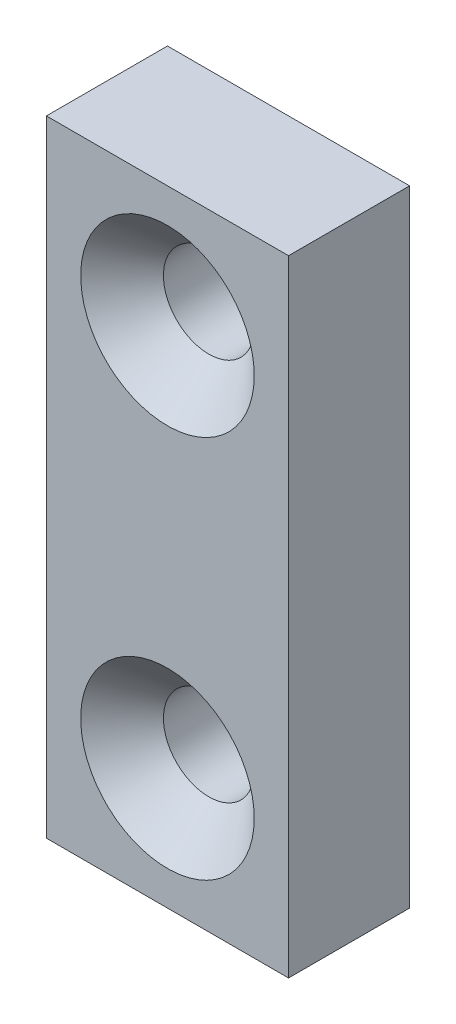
ISO-10303-21;
HEADER;
FILE_DESCRIPTION(('STEP AP214'),'2;1');
FILE_NAME('part.step','',(''),(''),'','','');
FILE_SCHEMA(('AUTOMOTIVE_DESIGN { 1 0 10303 214 1 1 1 1 }'));
ENDSEC;
DATA;
#1=APPLICATION_CONTEXT('core data for automotive mechanical design processes');
#2=APPLICATION_PROTOCOL_DEFINITION('international standard','automotive_design',2000,#1);
#3=PRODUCT_CONTEXT('',#1,'mechanical');
#4=PRODUCT('Part','Part','',(#3));
#5=PRODUCT_RELATED_PRODUCT_CATEGORY('part','',(#4));
#6=PRODUCT_DEFINITION_FORMATION('','',#4);
#7=PRODUCT_DEFINITION_CONTEXT('part definition',#1,'design');
#8=PRODUCT_DEFINITION('design','',#6,#7);
#9=PRODUCT_DEFINITION_SHAPE('','',#8);
#10=(LENGTH_UNIT() NAMED_UNIT(*) SI_UNIT(.MILLI.,.METRE.));
#11=(NAMED_UNIT(*) PLANE_ANGLE_UNIT() SI_UNIT($,.RADIAN.));
#12=(NAMED_UNIT(*) SI_UNIT($,.STERADIAN.) SOLID_ANGLE_UNIT());
#13=UNCERTAINTY_MEASURE_WITH_UNIT(LENGTH_MEASURE(1.E-05),#10,'distance_accuracy_value','');
#14=(GEOMETRIC_REPRESENTATION_CONTEXT(3) GLOBAL_UNCERTAINTY_ASSIGNED_CONTEXT((#13)) GLOBAL_UNIT_ASSIGNED_CONTEXT((#10,
#11,#12)) REPRESENTATION_CONTEXT('',''));
#15=CARTESIAN_POINT('',(0.,0.,0.));
#16=DIRECTION('',(0.,0.,1.));
#17=DIRECTION('',(1.,0.,0.));
#18=AXIS2_PLACEMENT_3D('',#15,#16,#17);
#19=CARTESIAN_POINT('',(-112.,-13.7078666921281,6.));
#20=DIRECTION('',(1.,0.,0.));
#21=DIRECTION('',(0.,0.,-1.));
#22=AXIS2_PLACEMENT_3D('',#19,#20,#21);
#23=PLANE('',#22);
#24=DIRECTION('',(0.,-1.,0.));
#25=VECTOR('',#24,1.);
#26=CARTESIAN_POINT('',(-112.,-13.7078666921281,0.));
#27=LINE('',#26,#25);
#28=CARTESIAN_POINT('',(-112.,17.2921333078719,0.));
#29=VERTEX_POINT('',#28);
#30=CARTESIAN_POINT('',(-112.,-13.7078666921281,0.));
#31=VERTEX_POINT('',#30);
#32=EDGE_CURVE('E79',#29,#31,#27,.T.);
#33=ORIENTED_EDGE('',*,*,#32,.T.);
#34=DIRECTION('',(0.,0.,-1.));
#35=VECTOR('',#34,1.);
#36=CARTESIAN_POINT('',(-112.,-13.7078666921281,6.));
#37=LINE('',#36,#35);
#38=CARTESIAN_POINT('',(-112.,-13.7078666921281,6.));
#39=VERTEX_POINT('',#38);
#40=EDGE_CURVE('E11',#39,#31,#37,.T.);
#41=ORIENTED_EDGE('',*,*,#40,.F.);
#42=DIRECTION('',(0.,-1.,0.));
#43=VECTOR('',#42,1.);
#44=CARTESIAN_POINT('',(-112.,-13.7078666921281,6.));
#45=LINE('',#44,#43);
#46=CARTESIAN_POINT('',(-112.,17.2921333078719,6.));
#47=VERTEX_POINT('',#46);
#48=EDGE_CURVE('E67',#47,#39,#45,.T.);
#49=ORIENTED_EDGE('',*,*,#48,.F.);
#50=DIRECTION('',(0.,0.,-1.));
#51=VECTOR('',#50,1.);
#52=CARTESIAN_POINT('',(-112.,17.2921333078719,6.));
#53=LINE('',#52,#51);
#54=EDGE_CURVE('E75',#47,#29,#53,.T.);
#55=ORIENTED_EDGE('',*,*,#54,.T.);
#56=EDGE_LOOP('',(#33,#41,#49,#55));
#57=FACE_BOUND('',#56,.T.);
#58=ADVANCED_FACE('F16',(#57),#23,.F.);
#59=CARTESIAN_POINT('',(-112.,-13.7078666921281,6.));
#60=DIRECTION('',(0.,1.,0.));
#61=DIRECTION('',(0.,0.,1.));
#62=AXIS2_PLACEMENT_3D('',#59,#60,#61);
#63=PLANE('',#62);
#64=DIRECTION('',(1.,0.,0.));
#65=VECTOR('',#64,1.);
#66=CARTESIAN_POINT('',(-112.,-13.7078666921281,0.));
#67=LINE('',#66,#65);
#68=CARTESIAN_POINT('',(-100.,-13.7078666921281,0.));
#69=VERTEX_POINT('',#68);
#70=EDGE_CURVE('E71',#31,#69,#67,.T.);
#71=ORIENTED_EDGE('',*,*,#70,.T.);
#72=DIRECTION('',(0.,0.,-1.));
#73=VECTOR('',#72,1.);
#74=CARTESIAN_POINT('',(-100.,-13.7078666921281,6.));
#75=LINE('',#74,#73);
#76=CARTESIAN_POINT('',(-100.,-13.7078666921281,6.));
#77=VERTEX_POINT('',#76);
#78=EDGE_CURVE('E24',#77,#69,#75,.T.);
#79=ORIENTED_EDGE('',*,*,#78,.F.);
#80=DIRECTION('',(1.,0.,0.));
#81=VECTOR('',#80,1.);
#82=CARTESIAN_POINT('',(-112.,-13.7078666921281,6.));
#83=LINE('',#82,#81);
#84=EDGE_CURVE('E62',#39,#77,#83,.T.);
#85=ORIENTED_EDGE('',*,*,#84,.F.);
#86=ORIENTED_EDGE('',*,*,#40,.T.);
#87=EDGE_LOOP('',(#71,#79,#85,#86));
#88=FACE_BOUND('',#87,.T.);
#89=ADVANCED_FACE('F70',(#88),#63,.F.);
#90=CARTESIAN_POINT('',(-100.,-13.7078666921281,6.));
#91=DIRECTION('',(-1.,0.,0.));
#92=DIRECTION('',(0.,0.,1.));
#93=AXIS2_PLACEMENT_3D('',#90,#91,#92);
#94=PLANE('',#93);
#95=DIRECTION('',(0.,1.,0.));
#96=VECTOR('',#95,1.);
#97=CARTESIAN_POINT('',(-100.,-13.7078666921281,0.));
#98=LINE('',#97,#96);
#99=CARTESIAN_POINT('',(-100.,17.2921333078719,0.));
#100=VERTEX_POINT('',#99);
#101=EDGE_CURVE('E49',#69,#100,#98,.T.);
#102=ORIENTED_EDGE('',*,*,#101,.T.);
#103=DIRECTION('',(0.,0.,-1.));
#104=VECTOR('',#103,1.);
#105=CARTESIAN_POINT('',(-100.,17.2921333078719,6.));
#106=LINE('',#105,#104);
#107=CARTESIAN_POINT('',(-100.,17.2921333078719,6.));
#108=VERTEX_POINT('',#107);
#109=EDGE_CURVE('E72',#108,#100,#106,.T.);
#110=ORIENTED_EDGE('',*,*,#109,.F.);
#111=DIRECTION('',(0.,1.,0.));
#112=VECTOR('',#111,1.);
#113=CARTESIAN_POINT('',(-100.,-13.7078666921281,6.));
#114=LINE('',#113,#112);
#115=EDGE_CURVE('E65',#77,#108,#114,.T.);
#116=ORIENTED_EDGE('',*,*,#115,.F.);
#117=ORIENTED_EDGE('',*,*,#78,.T.);
#118=EDGE_LOOP('',(#102,#110,#116,#117));
#119=FACE_BOUND('',#118,.T.);
#120=ADVANCED_FACE('F73',(#119),#94,.F.);
#121=CARTESIAN_POINT('',(-112.,17.2921333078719,6.));
#122=DIRECTION('',(0.,-1.,0.));
#123=DIRECTION('',(0.,0.,-1.));
#124=AXIS2_PLACEMENT_3D('',#121,#122,#123);
#125=PLANE('',#124);
#126=DIRECTION('',(-1.,0.,0.));
#127=VECTOR('',#126,1.);
#128=CARTESIAN_POINT('',(-112.,17.2921333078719,0.));
#129=LINE('',#128,#127);
#130=EDGE_CURVE('E55',#100,#29,#129,.T.);
#131=ORIENTED_EDGE('',*,*,#130,.T.);
#132=ORIENTED_EDGE('',*,*,#54,.F.);
#133=DIRECTION('',(-1.,0.,0.));
#134=VECTOR('',#133,1.);
#135=CARTESIAN_POINT('',(-112.,17.2921333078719,6.));
#136=LINE('',#135,#134);
#137=EDGE_CURVE('E32',#108,#47,#136,.T.);
#138=ORIENTED_EDGE('',*,*,#137,.F.);
#139=ORIENTED_EDGE('',*,*,#109,.T.);
#140=EDGE_LOOP('',(#131,#132,#138,#139));
#141=FACE_BOUND('',#140,.T.);
#142=ADVANCED_FACE('F87',(#141),#125,.F.);
#143=CARTESIAN_POINT('',(0.,0.,6.));
#144=DIRECTION('',(0.,0.,-1.));
#145=DIRECTION('',(-1.,0.,0.));
#146=AXIS2_PLACEMENT_3D('',#143,#144,#145);
#147=PLANE('',#146);
#148=CARTESIAN_POINT('',(-106.,-7.70786669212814,6.));
#149=DIRECTION('',(0.,0.,1.));
#150=DIRECTION('',(1.,0.,0.));
#151=AXIS2_PLACEMENT_3D('',#148,#149,#150);
#152=CIRCLE('',#151,4.3);
#153=CARTESIAN_POINT('',(-101.7,-7.70786669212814,6.));
#154=VERTEX_POINT('',#153);
#155=EDGE_CURVE('E107',#154,#154,#152,.T.);
#156=ORIENTED_EDGE('',*,*,#155,.F.);
#157=EDGE_LOOP('',(#156));
#158=FACE_BOUND('',#157,.T.);
#159=CARTESIAN_POINT('',(-106.,11.2921333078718,6.));
#160=DIRECTION('',(0.,0.,1.));
#161=DIRECTION('',(1.,0.,0.));
#162=AXIS2_PLACEMENT_3D('',#159,#160,#161);
#163=CIRCLE('',#162,4.3);
#164=CARTESIAN_POINT('',(-101.7,11.2921333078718,6.));
#165=VERTEX_POINT('',#164);
#166=EDGE_CURVE('E98',#165,#165,#163,.T.);
#167=ORIENTED_EDGE('',*,*,#166,.F.);
#168=EDGE_LOOP('',(#167));
#169=FACE_BOUND('',#168,.T.);
#170=ORIENTED_EDGE('',*,*,#48,.T.);
#171=ORIENTED_EDGE('',*,*,#84,.T.);
#172=ORIENTED_EDGE('',*,*,#115,.T.);
#173=ORIENTED_EDGE('',*,*,#137,.T.);
#174=EDGE_LOOP('',(#170,#171,#172,#173));
#175=FACE_BOUND('',#174,.T.);
#176=ADVANCED_FACE('F63',(#158,#169,#175),#147,.F.);
#177=CARTESIAN_POINT('',(0.,0.,0.));
#178=DIRECTION('',(0.,0.,-1.));
#179=DIRECTION('',(-1.,0.,0.));
#180=AXIS2_PLACEMENT_3D('',#177,#178,#179);
#181=PLANE('',#180);
#182=CARTESIAN_POINT('',(-106.,-7.70786669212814,0.));
#183=DIRECTION('',(0.,0.,1.));
#184=DIRECTION('',(1.,0.,0.));
#185=AXIS2_PLACEMENT_3D('',#182,#183,#184);
#186=CIRCLE('',#185,2.25);
#187=CARTESIAN_POINT('',(-103.75,-7.70786669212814,0.));
#188=VERTEX_POINT('',#187);
#189=EDGE_CURVE('E101',#188,#188,#186,.T.);
#190=ORIENTED_EDGE('',*,*,#189,.T.);
#191=EDGE_LOOP('',(#190));
#192=FACE_BOUND('',#191,.T.);
#193=CARTESIAN_POINT('',(-106.,11.2921333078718,0.));
#194=DIRECTION('',(0.,0.,1.));
#195=DIRECTION('',(1.,0.,0.));
#196=AXIS2_PLACEMENT_3D('',#193,#194,#195);
#197=CIRCLE('',#196,2.25);
#198=CARTESIAN_POINT('',(-103.75,11.2921333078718,0.));
#199=VERTEX_POINT('',#198);
#200=EDGE_CURVE('E82',#199,#199,#197,.T.);
#201=ORIENTED_EDGE('',*,*,#200,.T.);
#202=EDGE_LOOP('',(#201));
#203=FACE_BOUND('',#202,.T.);
#204=ORIENTED_EDGE('',*,*,#32,.F.);
#205=ORIENTED_EDGE('',*,*,#130,.F.);
#206=ORIENTED_EDGE('',*,*,#101,.F.);
#207=ORIENTED_EDGE('',*,*,#70,.F.);
#208=EDGE_LOOP('',(#204,#205,#206,#207));
#209=FACE_BOUND('',#208,.T.);
#210=ADVANCED_FACE('F90',(#192,#203,#209),#181,.T.);
#211=CARTESIAN_POINT('',(-106.,11.2921333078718,6.));
#212=DIRECTION('',(0.,0.,1.));
#213=DIRECTION('',(1.,0.,0.));
#214=AXIS2_PLACEMENT_3D('',#211,#212,#213);
#215=CYLINDRICAL_SURFACE('',#214,2.25);
#216=ORIENTED_EDGE('',*,*,#200,.F.);
#217=EDGE_LOOP('',(#216));
#218=FACE_BOUND('',#217,.T.);
#219=CARTESIAN_POINT('',(-106.,11.2921333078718,3.95));
#220=DIRECTION('',(0.,0.,1.));
#221=DIRECTION('',(1.,0.,0.));
#222=AXIS2_PLACEMENT_3D('',#219,#220,#221);
#223=CIRCLE('',#222,2.25);
#224=CARTESIAN_POINT('',(-103.75,11.2921333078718,3.95));
#225=VERTEX_POINT('',#224);
#226=EDGE_CURVE('E95',#225,#225,#223,.T.);
#227=ORIENTED_EDGE('',*,*,#226,.T.);
#228=EDGE_LOOP('',(#227));
#229=FACE_BOUND('',#228,.T.);
#230=ADVANCED_FACE('F121',(#218,#229),#215,.F.);
#231=CARTESIAN_POINT('',(-106.,11.2921333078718,6.));
#232=DIRECTION('',(0.,0.,1.));
#233=DIRECTION('',(1.,0.,0.));
#234=AXIS2_PLACEMENT_3D('',#231,#232,#233);
#235=CONICAL_SURFACE('',#234,4.3,0.785398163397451);
#236=ORIENTED_EDGE('',*,*,#226,.F.);
#237=EDGE_LOOP('',(#236));
#238=FACE_BOUND('',#237,.T.);
#239=ORIENTED_EDGE('',*,*,#166,.T.);
#240=EDGE_LOOP('',(#239));
#241=FACE_BOUND('',#240,.T.);
#242=ADVANCED_FACE('F118',(#238,#241),#235,.F.);
#243=CARTESIAN_POINT('',(-106.,-7.70786669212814,6.));
#244=DIRECTION('',(0.,0.,1.));
#245=DIRECTION('',(1.,0.,0.));
#246=AXIS2_PLACEMENT_3D('',#243,#244,#245);
#247=CYLINDRICAL_SURFACE('',#246,2.25);
#248=ORIENTED_EDGE('',*,*,#189,.F.);
#249=EDGE_LOOP('',(#248));
#250=FACE_BOUND('',#249,.T.);
#251=CARTESIAN_POINT('',(-106.,-7.70786669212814,3.95));
#252=DIRECTION('',(0.,0.,1.));
#253=DIRECTION('',(1.,0.,0.));
#254=AXIS2_PLACEMENT_3D('',#251,#252,#253);
#255=CIRCLE('',#254,2.25);
#256=CARTESIAN_POINT('',(-103.75,-7.70786669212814,3.95));
#257=VERTEX_POINT('',#256);
#258=EDGE_CURVE('E104',#257,#257,#255,.T.);
#259=ORIENTED_EDGE('',*,*,#258,.T.);
#260=EDGE_LOOP('',(#259));
#261=FACE_BOUND('',#260,.T.);
#262=ADVANCED_FACE('F120',(#250,#261),#247,.F.);
#263=CARTESIAN_POINT('',(-106.,-7.70786669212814,6.));
#264=DIRECTION('',(0.,0.,1.));
#265=DIRECTION('',(1.,0.,0.));
#266=AXIS2_PLACEMENT_3D('',#263,#264,#265);
#267=CONICAL_SURFACE('',#266,4.3,0.785398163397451);
#268=ORIENTED_EDGE('',*,*,#258,.F.);
#269=EDGE_LOOP('',(#268));
#270=FACE_BOUND('',#269,.T.);
#271=ORIENTED_EDGE('',*,*,#155,.T.);
#272=EDGE_LOOP('',(#271));
#273=FACE_BOUND('',#272,.T.);
#274=ADVANCED_FACE('F111',(#270,#273),#267,.F.);
#275=CLOSED_SHELL('',(#58,#89,#120,#142,#176,#210,#230,#242,#262,#274));
#276=MANIFOLD_SOLID_BREP('B1',#275);
#277=ADVANCED_BREP_SHAPE_REPRESENTATION('',(#18,#276),#14);
#278=SHAPE_DEFINITION_REPRESENTATION(#9,#277);
ENDSEC;
END-ISO-10303-21;
